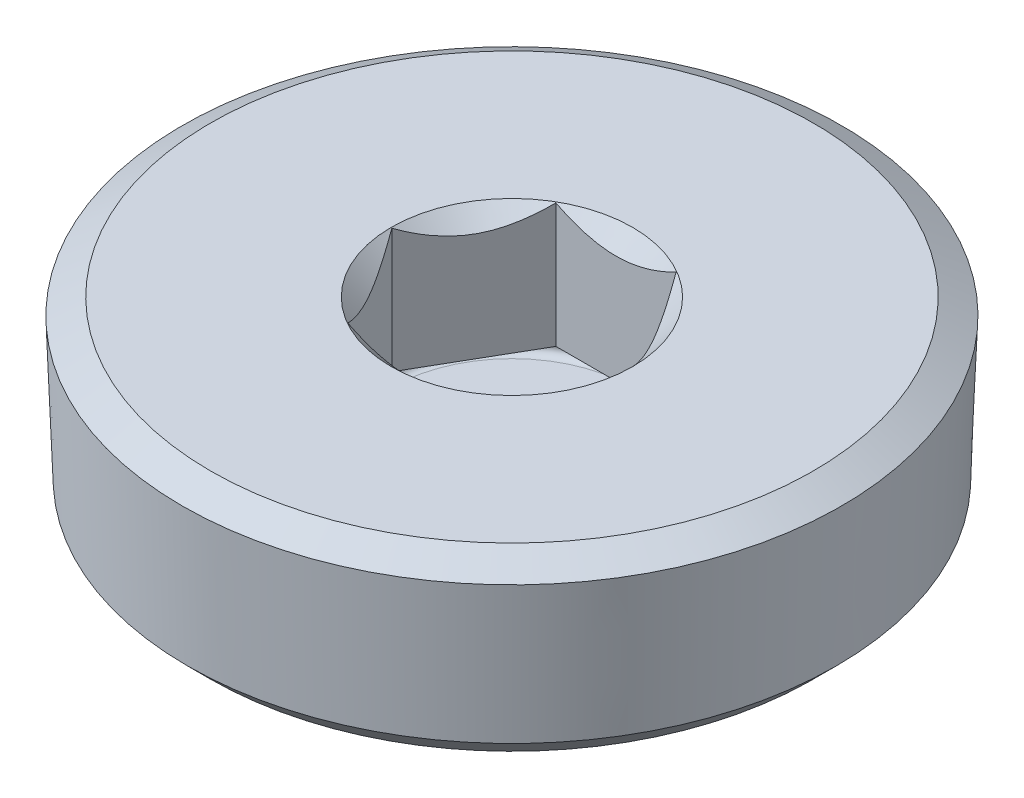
from build123d import *

# Parameters (mm, degrees)
CUT_EXTRUDE1_START = -11.43
CUT_EXTRUDE1_DEPTH = 11.379523


with BuildPart() as part:
    # Sketch2 → Revolve1 (revolve)
    with BuildSketch(Plane.XY, mode=Mode.PRIVATE) as revolve1_sk:
        Polygon((0, 0), (-27.592068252, 0), (-30.171700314, -1.489351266), (-29.700955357, -14.401112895), (-27.592068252, -16.51), (0, -16.51), align=None)
    revolve(revolve1_sk.sketch.rotate(Axis((0, 10.744282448, 0), (0, -1, 0)), 270), axis=Axis((0, 10.744282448, 0), (0, -1, 0)))

    # Sketch3 → Cut-Revolve1 (revolve, cut)
    with BuildSketch(Plane.XY, mode=Mode.PRIVATE) as cut_revolve1_sk:
        with BuildLine():
            Line((0, 0), (-11.049, 0))
            Line((-11.049, 0), (-9.525, -1.524))
            Line((-9.525, -1.524), (-9.525, -11.43))
            Line((-9.525, -11.43), (-11.049, -11.43))
            ThreePointArc((-11.049, -11.43), (-11.684, -12.065), (-11.049, -12.7))
            Line((-11.049, -12.7), (0, -12.7))
            Line((0, -12.7), (0, 0))
        make_face()
    revolve(cut_revolve1_sk.sketch.rotate(Axis((0, 2.934222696, 0), (0, -1, 0)), 270), axis=Axis((0, 2.934222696, 0), (0, -1, 0)), mode=Mode.SUBTRACT)

    # Sketch4 → Cut-Extrude1 (cut)
    with BuildSketch(Plane(origin=(0, 0, 0), x_dir=(1, 0, 0), z_dir=(0, 1, 0)).offset(CUT_EXTRUDE1_START)):
        Polygon((-5.499261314, -9.525), (5.499261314, -9.525), (10.998522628, 0), (5.499261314, 9.525), (-5.499261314, 9.525), (-10.998522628, 0), align=None)
    extrude(amount=CUT_EXTRUDE1_DEPTH, mode=Mode.SUBTRACT)


solid = part.part
